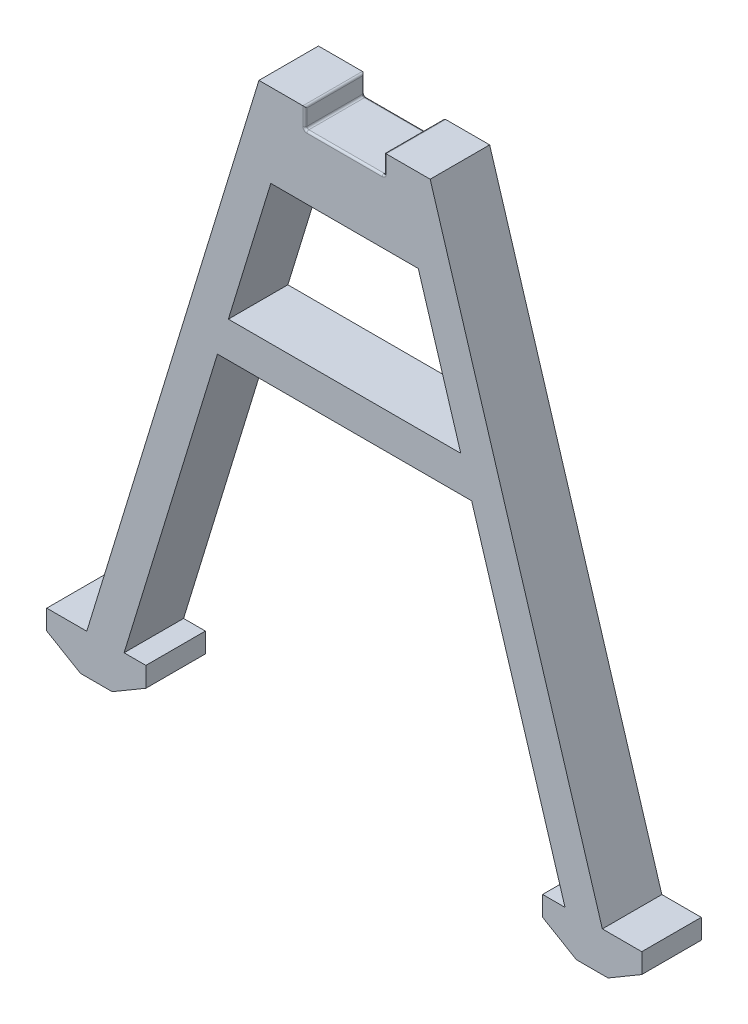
ISO-10303-21;
HEADER;
FILE_DESCRIPTION(('STEP AP214'),'2;1');
FILE_NAME('part.step','',(''),(''),'','','');
FILE_SCHEMA(('AUTOMOTIVE_DESIGN { 1 0 10303 214 1 1 1 1 }'));
ENDSEC;
DATA;
#1=APPLICATION_CONTEXT('core data for automotive mechanical design processes');
#2=APPLICATION_PROTOCOL_DEFINITION('international standard','automotive_design',2000,#1);
#3=PRODUCT_CONTEXT('',#1,'mechanical');
#4=PRODUCT('Part','Part','',(#3));
#5=PRODUCT_RELATED_PRODUCT_CATEGORY('part','',(#4));
#6=PRODUCT_DEFINITION_FORMATION('','',#4);
#7=PRODUCT_DEFINITION_CONTEXT('part definition',#1,'design');
#8=PRODUCT_DEFINITION('design','',#6,#7);
#9=PRODUCT_DEFINITION_SHAPE('','',#8);
#10=(LENGTH_UNIT() NAMED_UNIT(*) SI_UNIT(.MILLI.,.METRE.));
#11=(NAMED_UNIT(*) PLANE_ANGLE_UNIT() SI_UNIT($,.RADIAN.));
#12=(NAMED_UNIT(*) SI_UNIT($,.STERADIAN.) SOLID_ANGLE_UNIT());
#13=UNCERTAINTY_MEASURE_WITH_UNIT(LENGTH_MEASURE(1.E-05),#10,'distance_accuracy_value','');
#14=(GEOMETRIC_REPRESENTATION_CONTEXT(3) GLOBAL_UNCERTAINTY_ASSIGNED_CONTEXT((#13)) GLOBAL_UNIT_ASSIGNED_CONTEXT((#10,
#11,#12)) REPRESENTATION_CONTEXT('',''));
#15=CARTESIAN_POINT('',(0.,0.,0.));
#16=DIRECTION('',(0.,0.,1.));
#17=DIRECTION('',(1.,0.,0.));
#18=AXIS2_PLACEMENT_3D('',#15,#16,#17);
#19=CARTESIAN_POINT('',(0.,0.,7.5));
#20=DIRECTION('',(0.,0.,-1.));
#21=DIRECTION('',(-1.,0.,0.));
#22=AXIS2_PLACEMENT_3D('',#19,#20,#21);
#23=PLANE('',#22);
#24=DIRECTION('',(1.,0.,0.));
#25=VECTOR('',#24,1.);
#26=CARTESIAN_POINT('',(-29.2959355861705,101.,7.5));
#27=LINE('',#26,#25);
#28=CARTESIAN_POINT('',(-29.2959355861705,101.,7.5));
#29=VERTEX_POINT('',#28);
#30=CARTESIAN_POINT('',(29.2959355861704,101.,7.5));
#31=VERTEX_POINT('',#30);
#32=EDGE_CURVE('E329',#29,#31,#27,.T.);
#33=ORIENTED_EDGE('',*,*,#32,.F.);
#34=DIRECTION('',(-0.292371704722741,-0.956304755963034,0.));
#35=VECTOR('',#34,1.);
#36=CARTESIAN_POINT('',(-18.5953617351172,136.,7.5));
#37=LINE('',#36,#35);
#38=CARTESIAN_POINT('',(-18.5953617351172,136.,7.5));
#39=VERTEX_POINT('',#38);
#40=EDGE_CURVE('E327',#39,#29,#37,.T.);
#41=ORIENTED_EDGE('',*,*,#40,.F.);
#42=DIRECTION('',(-1.,0.,0.));
#43=VECTOR('',#42,1.);
#44=CARTESIAN_POINT('',(18.5953617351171,136.,7.5));
#45=LINE('',#44,#43);
#46=CARTESIAN_POINT('',(18.5953617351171,136.,7.5));
#47=VERTEX_POINT('',#46);
#48=EDGE_CURVE('E335',#47,#39,#45,.T.);
#49=ORIENTED_EDGE('',*,*,#48,.F.);
#50=DIRECTION('',(-0.292371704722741,0.956304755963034,0.));
#51=VECTOR('',#50,1.);
#52=CARTESIAN_POINT('',(29.2959355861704,101.,7.5));
#53=LINE('',#52,#51);
#54=EDGE_CURVE('E332',#31,#47,#53,.T.);
#55=ORIENTED_EDGE('',*,*,#54,.F.);
#56=EDGE_LOOP('',(#33,#41,#49,#55));
#57=FACE_BOUND('',#56,.T.);
#58=DIRECTION('',(0.,1.,0.));
#59=VECTOR('',#58,1.);
#60=CARTESIAN_POINT('',(-75.091397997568,0.,7.5));
#61=LINE('',#60,#59);
#62=CARTESIAN_POINT('',(-75.091397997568,10.,7.5));
#63=VERTEX_POINT('',#62);
#64=CARTESIAN_POINT('',(-75.091397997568,15.,7.5));
#65=VERTEX_POINT('',#64);
#66=EDGE_CURVE('E297',#63,#65,#61,.T.);
#67=ORIENTED_EDGE('',*,*,#66,.F.);
#68=DIRECTION('',(-0.86193421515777,0.507020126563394,0.));
#69=VECTOR('',#68,1.);
#70=CARTESIAN_POINT('',(-75.091397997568,10.,7.5));
#71=LINE('',#70,#69);
#72=CARTESIAN_POINT('',(-66.591397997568,5.,7.5));
#73=VERTEX_POINT('',#72);
#74=EDGE_CURVE('E276',#73,#63,#71,.T.);
#75=ORIENTED_EDGE('',*,*,#74,.F.);
#76=DIRECTION('',(-1.,0.,0.));
#77=VECTOR('',#76,1.);
#78=CARTESIAN_POINT('',(-75.091397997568,5.,7.5));
#79=LINE('',#78,#77);
#80=CARTESIAN_POINT('',(-58.591397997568,5.,7.5));
#81=VERTEX_POINT('',#80);
#82=EDGE_CURVE('E591',#81,#73,#79,.T.);
#83=ORIENTED_EDGE('',*,*,#82,.F.);
#84=DIRECTION('',(-0.86193421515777,-0.507020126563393,0.));
#85=VECTOR('',#84,1.);
#86=CARTESIAN_POINT('',(-58.591397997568,5.,7.5));
#87=LINE('',#86,#85);
#88=CARTESIAN_POINT('',(-50.091397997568,10.,7.5));
#89=VERTEX_POINT('',#88);
#90=EDGE_CURVE('E66',#89,#81,#87,.T.);
#91=ORIENTED_EDGE('',*,*,#90,.F.);
#92=DIRECTION('',(0.,1.,0.));
#93=VECTOR('',#92,1.);
#94=CARTESIAN_POINT('',(-50.091397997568,0.,7.5));
#95=LINE('',#94,#93);
#96=CARTESIAN_POINT('',(-50.091397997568,15.,7.5));
#97=VERTEX_POINT('',#96);
#98=EDGE_CURVE('E300',#89,#97,#95,.T.);
#99=ORIENTED_EDGE('',*,*,#98,.T.);
#100=DIRECTION('',(1.,0.,0.));
#101=VECTOR('',#100,1.);
#102=CARTESIAN_POINT('',(-75.091397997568,15.,7.5));
#103=LINE('',#102,#101);
#104=CARTESIAN_POINT('',(-55.5887741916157,15.,7.5));
#105=VERTEX_POINT('',#104);
#106=EDGE_CURVE('E510',#105,#97,#103,.T.);
#107=ORIENTED_EDGE('',*,*,#106,.F.);
#108=DIRECTION('',(-0.292371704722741,-0.956304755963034,0.));
#109=VECTOR('',#108,1.);
#110=CARTESIAN_POINT('',(-32.0475117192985,92.,7.5));
#111=LINE('',#110,#109);
#112=CARTESIAN_POINT('',(-32.0475117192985,92.,7.5));
#113=VERTEX_POINT('',#112);
#114=EDGE_CURVE('E306',#113,#105,#111,.T.);
#115=ORIENTED_EDGE('',*,*,#114,.F.);
#116=DIRECTION('',(-1.,0.,0.));
#117=VECTOR('',#116,1.);
#118=CARTESIAN_POINT('',(32.0475117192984,92.,7.5));
#119=LINE('',#118,#117);
#120=CARTESIAN_POINT('',(32.0475117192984,92.,7.5));
#121=VERTEX_POINT('',#120);
#122=EDGE_CURVE('E313',#121,#113,#119,.T.);
#123=ORIENTED_EDGE('',*,*,#122,.F.);
#124=DIRECTION('',(-0.292371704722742,0.956304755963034,0.));
#125=VECTOR('',#124,1.);
#126=CARTESIAN_POINT('',(55.5887741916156,15.,7.5));
#127=LINE('',#126,#125);
#128=CARTESIAN_POINT('',(55.5887741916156,15.,7.5));
#129=VERTEX_POINT('',#128);
#130=EDGE_CURVE('E309',#129,#121,#127,.T.);
#131=ORIENTED_EDGE('',*,*,#130,.F.);
#132=DIRECTION('',(1.,0.,0.));
#133=VECTOR('',#132,1.);
#134=CARTESIAN_POINT('',(49.9385869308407,15.,7.5));
#135=LINE('',#134,#133);
#136=CARTESIAN_POINT('',(49.9385869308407,15.,7.5));
#137=VERTEX_POINT('',#136);
#138=EDGE_CURVE('E550',#137,#129,#135,.T.);
#139=ORIENTED_EDGE('',*,*,#138,.F.);
#140=DIRECTION('',(0.,1.,0.));
#141=VECTOR('',#140,1.);
#142=CARTESIAN_POINT('',(49.9385869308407,0.,7.5));
#143=LINE('',#142,#141);
#144=CARTESIAN_POINT('',(49.9385869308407,10.,7.5));
#145=VERTEX_POINT('',#144);
#146=EDGE_CURVE('E553',#145,#137,#143,.T.);
#147=ORIENTED_EDGE('',*,*,#146,.F.);
#148=DIRECTION('',(-0.86193421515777,0.507020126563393,0.));
#149=VECTOR('',#148,1.);
#150=CARTESIAN_POINT('',(49.9385869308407,10.,7.5));
#151=LINE('',#150,#149);
#152=CARTESIAN_POINT('',(58.4385869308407,5.,7.5));
#153=VERTEX_POINT('',#152);
#154=EDGE_CURVE('E614',#153,#145,#151,.T.);
#155=ORIENTED_EDGE('',*,*,#154,.F.);
#156=DIRECTION('',(-1.,0.,0.));
#157=VECTOR('',#156,1.);
#158=CARTESIAN_POINT('',(49.9385869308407,5.,7.5));
#159=LINE('',#158,#157);
#160=CARTESIAN_POINT('',(66.4385869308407,5.,7.5));
#161=VERTEX_POINT('',#160);
#162=EDGE_CURVE('E280',#161,#153,#159,.T.);
#163=ORIENTED_EDGE('',*,*,#162,.F.);
#164=DIRECTION('',(-0.86193421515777,-0.507020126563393,0.));
#165=VECTOR('',#164,1.);
#166=CARTESIAN_POINT('',(74.9385869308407,10.,7.5));
#167=LINE('',#166,#165);
#168=CARTESIAN_POINT('',(74.9385869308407,10.,7.5));
#169=VERTEX_POINT('',#168);
#170=EDGE_CURVE('E606',#169,#161,#167,.T.);
#171=ORIENTED_EDGE('',*,*,#170,.F.);
#172=DIRECTION('',(0.,1.,0.));
#173=VECTOR('',#172,1.);
#174=CARTESIAN_POINT('',(74.9385869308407,0.,7.5));
#175=LINE('',#174,#173);
#176=CARTESIAN_POINT('',(74.9385869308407,15.,7.5));
#177=VERTEX_POINT('',#176);
#178=EDGE_CURVE('E531',#169,#177,#175,.T.);
#179=ORIENTED_EDGE('',*,*,#178,.T.);
#180=CARTESIAN_POINT('',(65.,15.,7.5));
#181=VERTEX_POINT('',#180);
#182=EDGE_CURVE('E556',#181,#177,#135,.T.);
#183=ORIENTED_EDGE('',*,*,#182,.F.);
#184=DIRECTION('',(-0.292371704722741,0.956304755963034,0.));
#185=VECTOR('',#184,1.);
#186=CARTESIAN_POINT('',(21.5862432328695,157.,7.5));
#187=LINE('',#186,#185);
#188=CARTESIAN_POINT('',(21.5862432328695,157.,7.5));
#189=VERTEX_POINT('',#188);
#190=EDGE_CURVE('E346',#181,#189,#187,.T.);
#191=ORIENTED_EDGE('',*,*,#190,.T.);
#192=DIRECTION('',(-1.,0.,0.));
#193=VECTOR('',#192,1.);
#194=CARTESIAN_POINT('',(-21.5862432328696,157.,7.5));
#195=LINE('',#194,#193);
#196=CARTESIAN_POINT('',(10.5,157.,7.5));
#197=VERTEX_POINT('',#196);
#198=EDGE_CURVE('E350',#189,#197,#195,.T.);
#199=ORIENTED_EDGE('',*,*,#198,.T.);
#200=DIRECTION('',(0.,1.,0.));
#201=VECTOR('',#200,1.);
#202=CARTESIAN_POINT('',(10.5,0.,7.5));
#203=LINE('',#202,#201);
#204=CARTESIAN_POINT('',(10.5,152.5,7.5));
#205=VERTEX_POINT('',#204);
#206=EDGE_CURVE('E423',#197,#205,#203,.F.);
#207=ORIENTED_EDGE('',*,*,#206,.T.);
#208=CARTESIAN_POINT('',(9.5,152.5,7.5));
#209=DIRECTION('',(0.,0.,-1.));
#210=DIRECTION('',(-1.,0.,0.));
#211=AXIS2_PLACEMENT_3D('',#208,#209,#210);
#212=CIRCLE('',#211,1.);
#213=CARTESIAN_POINT('',(9.5,151.5,7.5));
#214=VERTEX_POINT('',#213);
#215=EDGE_CURVE('E420',#214,#205,#212,.F.);
#216=ORIENTED_EDGE('',*,*,#215,.F.);
#217=DIRECTION('',(1.,0.,0.));
#218=VECTOR('',#217,1.);
#219=CARTESIAN_POINT('',(0.,151.5,7.5));
#220=LINE('',#219,#218);
#221=CARTESIAN_POINT('',(-9.5,151.5,7.5));
#222=VERTEX_POINT('',#221);
#223=EDGE_CURVE('E416',#214,#222,#220,.F.);
#224=ORIENTED_EDGE('',*,*,#223,.T.);
#225=CARTESIAN_POINT('',(-9.5,152.5,7.5));
#226=DIRECTION('',(0.,0.,-1.));
#227=DIRECTION('',(-1.,0.,0.));
#228=AXIS2_PLACEMENT_3D('',#225,#226,#227);
#229=CIRCLE('',#228,1.);
#230=CARTESIAN_POINT('',(-10.5,152.5,7.5));
#231=VERTEX_POINT('',#230);
#232=EDGE_CURVE('E413',#231,#222,#229,.F.);
#233=ORIENTED_EDGE('',*,*,#232,.F.);
#234=DIRECTION('',(0.,-1.,0.));
#235=VECTOR('',#234,1.);
#236=CARTESIAN_POINT('',(-10.5,0.,7.5));
#237=LINE('',#236,#235);
#238=CARTESIAN_POINT('',(-10.5,157.,7.5));
#239=VERTEX_POINT('',#238);
#240=EDGE_CURVE('E418',#231,#239,#237,.F.);
#241=ORIENTED_EDGE('',*,*,#240,.T.);
#242=CARTESIAN_POINT('',(-21.5862432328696,157.,7.5));
#243=VERTEX_POINT('',#242);
#244=EDGE_CURVE('E348',#239,#243,#195,.T.);
#245=ORIENTED_EDGE('',*,*,#244,.T.);
#246=DIRECTION('',(-0.292371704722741,-0.956304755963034,0.));
#247=VECTOR('',#246,1.);
#248=CARTESIAN_POINT('',(-65.,15.,7.5));
#249=LINE('',#248,#247);
#250=CARTESIAN_POINT('',(-65.,15.,7.5));
#251=VERTEX_POINT('',#250);
#252=EDGE_CURVE('E353',#243,#251,#249,.T.);
#253=ORIENTED_EDGE('',*,*,#252,.T.);
#254=EDGE_CURVE('E302',#65,#251,#103,.T.);
#255=ORIENTED_EDGE('',*,*,#254,.F.);
#256=EDGE_LOOP('',(#67,#75,#83,#91,#99,#107,#115,#123,#131,#139,#147,#155,#163,#171,#179,#183,
#191,#199,#207,#216,#224,#233,#241,#245,#253,#255));
#257=FACE_BOUND('',#256,.T.);
#258=ADVANCED_FACE('F41',(#57,#257),#23,.F.);
#259=CARTESIAN_POINT('',(0.,0.,-7.5));
#260=DIRECTION('',(0.,0.,-1.));
#261=DIRECTION('',(-1.,0.,0.));
#262=AXIS2_PLACEMENT_3D('',#259,#260,#261);
#263=PLANE('',#262);
#264=DIRECTION('',(-0.86193421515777,0.507020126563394,0.));
#265=VECTOR('',#264,1.);
#266=CARTESIAN_POINT('',(-75.091397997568,10.,-7.5));
#267=LINE('',#266,#265);
#268=CARTESIAN_POINT('',(-66.591397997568,5.,-7.5));
#269=VERTEX_POINT('',#268);
#270=CARTESIAN_POINT('',(-75.091397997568,10.,-7.5));
#271=VERTEX_POINT('',#270);
#272=EDGE_CURVE('E58',#269,#271,#267,.T.);
#273=ORIENTED_EDGE('',*,*,#272,.T.);
#274=DIRECTION('',(0.,1.,0.));
#275=VECTOR('',#274,1.);
#276=CARTESIAN_POINT('',(-75.091397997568,0.,-7.5));
#277=LINE('',#276,#275);
#278=CARTESIAN_POINT('',(-75.091397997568,15.,-7.5));
#279=VERTEX_POINT('',#278);
#280=EDGE_CURVE('E287',#271,#279,#277,.T.);
#281=ORIENTED_EDGE('',*,*,#280,.T.);
#282=DIRECTION('',(-1.,0.,0.));
#283=VECTOR('',#282,1.);
#284=CARTESIAN_POINT('',(-75.091397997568,15.,-7.5));
#285=LINE('',#284,#283);
#286=CARTESIAN_POINT('',(-65.,15.,-7.5));
#287=VERTEX_POINT('',#286);
#288=EDGE_CURVE('E513',#287,#279,#285,.T.);
#289=ORIENTED_EDGE('',*,*,#288,.F.);
#290=DIRECTION('',(-0.292371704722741,-0.956304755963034,0.));
#291=VECTOR('',#290,1.);
#292=CARTESIAN_POINT('',(-65.,15.,-7.5));
#293=LINE('',#292,#291);
#294=CARTESIAN_POINT('',(-21.5862432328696,157.,-7.5));
#295=VERTEX_POINT('',#294);
#296=EDGE_CURVE('E349',#295,#287,#293,.T.);
#297=ORIENTED_EDGE('',*,*,#296,.F.);
#298=DIRECTION('',(-1.,0.,0.));
#299=VECTOR('',#298,1.);
#300=CARTESIAN_POINT('',(-21.5862432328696,157.,-7.5));
#301=LINE('',#300,#299);
#302=CARTESIAN_POINT('',(-10.5,157.,-7.5));
#303=VERTEX_POINT('',#302);
#304=EDGE_CURVE('E358',#303,#295,#301,.T.);
#305=ORIENTED_EDGE('',*,*,#304,.F.);
#306=DIRECTION('',(0.,1.,0.));
#307=VECTOR('',#306,1.);
#308=CARTESIAN_POINT('',(-10.5,152.,-7.5));
#309=LINE('',#308,#307);
#310=CARTESIAN_POINT('',(-10.5,152.5,-7.5));
#311=VERTEX_POINT('',#310);
#312=EDGE_CURVE('E408',#303,#311,#309,.F.);
#313=ORIENTED_EDGE('',*,*,#312,.T.);
#314=CARTESIAN_POINT('',(-9.5,152.5,-7.5));
#315=DIRECTION('',(0.,0.,-1.));
#316=DIRECTION('',(-1.,0.,0.));
#317=AXIS2_PLACEMENT_3D('',#314,#315,#316);
#318=CIRCLE('',#317,1.);
#319=CARTESIAN_POINT('',(-9.5,151.5,-7.5));
#320=VERTEX_POINT('',#319);
#321=EDGE_CURVE('E405',#320,#311,#318,.T.);
#322=ORIENTED_EDGE('',*,*,#321,.F.);
#323=DIRECTION('',(-1.,0.,0.));
#324=VECTOR('',#323,1.);
#325=CARTESIAN_POINT('',(10.,151.5,-7.5));
#326=LINE('',#325,#324);
#327=CARTESIAN_POINT('',(9.5,151.5,-7.5));
#328=VERTEX_POINT('',#327);
#329=EDGE_CURVE('E403',#320,#328,#326,.F.);
#330=ORIENTED_EDGE('',*,*,#329,.T.);
#331=CARTESIAN_POINT('',(9.5,152.5,-7.5));
#332=DIRECTION('',(0.,0.,-1.));
#333=DIRECTION('',(-1.,0.,0.));
#334=AXIS2_PLACEMENT_3D('',#331,#332,#333);
#335=CIRCLE('',#334,1.);
#336=CARTESIAN_POINT('',(10.5,152.5,-7.5));
#337=VERTEX_POINT('',#336);
#338=EDGE_CURVE('E400',#337,#328,#335,.T.);
#339=ORIENTED_EDGE('',*,*,#338,.F.);
#340=DIRECTION('',(0.,-1.,0.));
#341=VECTOR('',#340,1.);
#342=CARTESIAN_POINT('',(10.5,157.,-7.5));
#343=LINE('',#342,#341);
#344=CARTESIAN_POINT('',(10.5,157.,-7.5));
#345=VERTEX_POINT('',#344);
#346=EDGE_CURVE('E410',#337,#345,#343,.F.);
#347=ORIENTED_EDGE('',*,*,#346,.T.);
#348=CARTESIAN_POINT('',(21.5862432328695,157.,-7.5));
#349=VERTEX_POINT('',#348);
#350=EDGE_CURVE('E359',#349,#345,#301,.T.);
#351=ORIENTED_EDGE('',*,*,#350,.F.);
#352=DIRECTION('',(-0.292371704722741,0.956304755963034,0.));
#353=VECTOR('',#352,1.);
#354=CARTESIAN_POINT('',(21.5862432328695,157.,-7.5));
#355=LINE('',#354,#353);
#356=CARTESIAN_POINT('',(65.,15.,-7.5));
#357=VERTEX_POINT('',#356);
#358=EDGE_CURVE('E319',#357,#349,#355,.T.);
#359=ORIENTED_EDGE('',*,*,#358,.F.);
#360=DIRECTION('',(-1.,0.,0.));
#361=VECTOR('',#360,1.);
#362=CARTESIAN_POINT('',(49.9385869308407,15.,-7.5));
#363=LINE('',#362,#361);
#364=CARTESIAN_POINT('',(74.9385869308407,15.,-7.5));
#365=VERTEX_POINT('',#364);
#366=EDGE_CURVE('E565',#365,#357,#363,.T.);
#367=ORIENTED_EDGE('',*,*,#366,.F.);
#368=DIRECTION('',(0.,1.,0.));
#369=VECTOR('',#368,1.);
#370=CARTESIAN_POINT('',(74.9385869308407,0.,-7.5));
#371=LINE('',#370,#369);
#372=CARTESIAN_POINT('',(74.9385869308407,10.,-7.5));
#373=VERTEX_POINT('',#372);
#374=EDGE_CURVE('E555',#373,#365,#371,.T.);
#375=ORIENTED_EDGE('',*,*,#374,.F.);
#376=DIRECTION('',(-0.86193421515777,-0.507020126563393,0.));
#377=VECTOR('',#376,1.);
#378=CARTESIAN_POINT('',(74.9385869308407,10.,-7.5));
#379=LINE('',#378,#377);
#380=CARTESIAN_POINT('',(66.4385869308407,5.,-7.5));
#381=VERTEX_POINT('',#380);
#382=EDGE_CURVE('E603',#373,#381,#379,.T.);
#383=ORIENTED_EDGE('',*,*,#382,.T.);
#384=DIRECTION('',(1.,0.,0.));
#385=VECTOR('',#384,1.);
#386=CARTESIAN_POINT('',(49.9385869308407,5.,-7.5));
#387=LINE('',#386,#385);
#388=CARTESIAN_POINT('',(58.4385869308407,5.,-7.5));
#389=VERTEX_POINT('',#388);
#390=EDGE_CURVE('E594',#389,#381,#387,.T.);
#391=ORIENTED_EDGE('',*,*,#390,.F.);
#392=DIRECTION('',(-0.86193421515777,0.507020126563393,0.));
#393=VECTOR('',#392,1.);
#394=CARTESIAN_POINT('',(49.9385869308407,10.,-7.5));
#395=LINE('',#394,#393);
#396=CARTESIAN_POINT('',(49.9385869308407,10.,-7.5));
#397=VERTEX_POINT('',#396);
#398=EDGE_CURVE('E620',#389,#397,#395,.T.);
#399=ORIENTED_EDGE('',*,*,#398,.T.);
#400=DIRECTION('',(0.,1.,0.));
#401=VECTOR('',#400,1.);
#402=CARTESIAN_POINT('',(49.9385869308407,0.,-7.5));
#403=LINE('',#402,#401);
#404=CARTESIAN_POINT('',(49.9385869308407,15.,-7.5));
#405=VERTEX_POINT('',#404);
#406=EDGE_CURVE('E573',#397,#405,#403,.T.);
#407=ORIENTED_EDGE('',*,*,#406,.T.);
#408=CARTESIAN_POINT('',(55.5887741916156,15.,-7.5));
#409=VERTEX_POINT('',#408);
#410=EDGE_CURVE('E562',#409,#405,#363,.T.);
#411=ORIENTED_EDGE('',*,*,#410,.F.);
#412=DIRECTION('',(0.292371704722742,-0.956304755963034,0.));
#413=VECTOR('',#412,1.);
#414=CARTESIAN_POINT('',(55.030925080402,16.8246422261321,-7.5));
#415=LINE('',#414,#413);
#416=CARTESIAN_POINT('',(32.0475117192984,92.,-7.5));
#417=VERTEX_POINT('',#416);
#418=EDGE_CURVE('E384',#417,#409,#415,.T.);
#419=ORIENTED_EDGE('',*,*,#418,.F.);
#420=DIRECTION('',(1.,0.,0.));
#421=VECTOR('',#420,1.);
#422=CARTESIAN_POINT('',(0.,92.,-7.5));
#423=LINE('',#422,#421);
#424=CARTESIAN_POINT('',(-32.0475117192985,92.,-7.5));
#425=VERTEX_POINT('',#424);
#426=EDGE_CURVE('E387',#425,#417,#423,.T.);
#427=ORIENTED_EDGE('',*,*,#426,.F.);
#428=DIRECTION('',(0.292371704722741,0.956304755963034,0.));
#429=VECTOR('',#428,1.);
#430=CARTESIAN_POINT('',(-55.0309250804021,16.8246422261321,-7.5));
#431=LINE('',#430,#429);
#432=CARTESIAN_POINT('',(-55.5887741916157,15.,-7.5));
#433=VERTEX_POINT('',#432);
#434=EDGE_CURVE('E389',#433,#425,#431,.T.);
#435=ORIENTED_EDGE('',*,*,#434,.F.);
#436=CARTESIAN_POINT('',(-50.091397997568,15.,-7.5));
#437=VERTEX_POINT('',#436);
#438=EDGE_CURVE('E514',#437,#433,#285,.T.);
#439=ORIENTED_EDGE('',*,*,#438,.F.);
#440=DIRECTION('',(0.,1.,0.));
#441=VECTOR('',#440,1.);
#442=CARTESIAN_POINT('',(-50.091397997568,0.,-7.5));
#443=LINE('',#442,#441);
#444=CARTESIAN_POINT('',(-50.091397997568,10.,-7.5));
#445=VERTEX_POINT('',#444);
#446=EDGE_CURVE('E298',#445,#437,#443,.T.);
#447=ORIENTED_EDGE('',*,*,#446,.F.);
#448=DIRECTION('',(-0.86193421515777,-0.507020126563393,0.));
#449=VECTOR('',#448,1.);
#450=CARTESIAN_POINT('',(-58.591397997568,5.,-7.5));
#451=LINE('',#450,#449);
#452=CARTESIAN_POINT('',(-58.591397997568,5.,-7.5));
#453=VERTEX_POINT('',#452);
#454=EDGE_CURVE('E612',#445,#453,#451,.T.);
#455=ORIENTED_EDGE('',*,*,#454,.T.);
#456=DIRECTION('',(1.,0.,0.));
#457=VECTOR('',#456,1.);
#458=CARTESIAN_POINT('',(-75.091397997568,5.,-7.5));
#459=LINE('',#458,#457);
#460=EDGE_CURVE('E291',#269,#453,#459,.T.);
#461=ORIENTED_EDGE('',*,*,#460,.F.);
#462=EDGE_LOOP('',(#273,#281,#289,#297,#305,#313,#322,#330,#339,#347,#351,#359,#367,#375,#383,
#391,#399,#407,#411,#419,#427,#435,#439,#447,#455,#461));
#463=FACE_BOUND('',#462,.T.);
#464=DIRECTION('',(0.292371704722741,0.956304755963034,0.));
#465=VECTOR('',#464,1.);
#466=CARTESIAN_POINT('',(-55.0309250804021,16.8246422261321,-7.5));
#467=LINE('',#466,#465);
#468=CARTESIAN_POINT('',(-29.2959355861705,101.,-7.5));
#469=VERTEX_POINT('',#468);
#470=CARTESIAN_POINT('',(-18.5953617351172,136.,-7.5));
#471=VERTEX_POINT('',#470);
#472=EDGE_CURVE('E382',#469,#471,#467,.T.);
#473=ORIENTED_EDGE('',*,*,#472,.F.);
#474=DIRECTION('',(-1.,0.,0.));
#475=VECTOR('',#474,1.);
#476=CARTESIAN_POINT('',(0.,101.,-7.5));
#477=LINE('',#476,#475);
#478=CARTESIAN_POINT('',(29.2959355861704,101.,-7.5));
#479=VERTEX_POINT('',#478);
#480=EDGE_CURVE('E375',#479,#469,#477,.T.);
#481=ORIENTED_EDGE('',*,*,#480,.F.);
#482=DIRECTION('',(0.292371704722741,-0.956304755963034,0.));
#483=VECTOR('',#482,1.);
#484=CARTESIAN_POINT('',(55.030925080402,16.8246422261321,-7.5));
#485=LINE('',#484,#483);
#486=CARTESIAN_POINT('',(18.5953617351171,136.,-7.5));
#487=VERTEX_POINT('',#486);
#488=EDGE_CURVE('E377',#487,#479,#485,.T.);
#489=ORIENTED_EDGE('',*,*,#488,.F.);
#490=DIRECTION('',(1.,0.,0.));
#491=VECTOR('',#490,1.);
#492=CARTESIAN_POINT('',(0.,136.,-7.5));
#493=LINE('',#492,#491);
#494=EDGE_CURVE('E380',#471,#487,#493,.T.);
#495=ORIENTED_EDGE('',*,*,#494,.F.);
#496=EDGE_LOOP('',(#473,#481,#489,#495));
#497=FACE_BOUND('',#496,.T.);
#498=ADVANCED_FACE('F285',(#463,#497),#263,.T.);
#499=CARTESIAN_POINT('',(49.9385869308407,0.,-7.5));
#500=DIRECTION('',(-1.,0.,0.));
#501=DIRECTION('',(0.,0.,1.));
#502=AXIS2_PLACEMENT_3D('',#499,#500,#501);
#503=PLANE('',#502);
#504=DIRECTION('',(0.,0.,1.));
#505=VECTOR('',#504,1.);
#506=CARTESIAN_POINT('',(49.9385869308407,10.,-7.5));
#507=LINE('',#506,#505);
#508=EDGE_CURVE('E619',#397,#145,#507,.T.);
#509=ORIENTED_EDGE('',*,*,#508,.T.);
#510=ORIENTED_EDGE('',*,*,#146,.T.);
#511=DIRECTION('',(0.,0.,1.));
#512=VECTOR('',#511,1.);
#513=CARTESIAN_POINT('',(49.9385869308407,15.,-7.5));
#514=LINE('',#513,#512);
#515=EDGE_CURVE('E560',#405,#137,#514,.T.);
#516=ORIENTED_EDGE('',*,*,#515,.F.);
#517=ORIENTED_EDGE('',*,*,#406,.F.);
#518=EDGE_LOOP('',(#509,#510,#516,#517));
#519=FACE_BOUND('',#518,.T.);
#520=ADVANCED_FACE('F648',(#519),#503,.T.);
#521=CARTESIAN_POINT('',(74.9385869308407,0.,-7.5));
#522=DIRECTION('',(1.,0.,0.));
#523=DIRECTION('',(0.,0.,-1.));
#524=AXIS2_PLACEMENT_3D('',#521,#522,#523);
#525=PLANE('',#524);
#526=DIRECTION('',(0.,0.,1.));
#527=VECTOR('',#526,1.);
#528=CARTESIAN_POINT('',(74.9385869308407,10.,-7.5));
#529=LINE('',#528,#527);
#530=EDGE_CURVE('E584',#373,#169,#529,.T.);
#531=ORIENTED_EDGE('',*,*,#530,.F.);
#532=ORIENTED_EDGE('',*,*,#374,.T.);
#533=DIRECTION('',(0.,0.,-1.));
#534=VECTOR('',#533,1.);
#535=CARTESIAN_POINT('',(74.9385869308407,15.,-7.5));
#536=LINE('',#535,#534);
#537=EDGE_CURVE('E583',#177,#365,#536,.T.);
#538=ORIENTED_EDGE('',*,*,#537,.F.);
#539=ORIENTED_EDGE('',*,*,#178,.F.);
#540=EDGE_LOOP('',(#531,#532,#538,#539));
#541=FACE_BOUND('',#540,.T.);
#542=ADVANCED_FACE('F580',(#541),#525,.T.);
#543=CARTESIAN_POINT('',(-50.091397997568,0.,-7.5));
#544=DIRECTION('',(1.,0.,0.));
#545=DIRECTION('',(0.,0.,-1.));
#546=AXIS2_PLACEMENT_3D('',#543,#544,#545);
#547=PLANE('',#546);
#548=DIRECTION('',(0.,0.,1.));
#549=VECTOR('',#548,1.);
#550=CARTESIAN_POINT('',(-50.091397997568,10.,-7.5));
#551=LINE('',#550,#549);
#552=EDGE_CURVE('E609',#445,#89,#551,.T.);
#553=ORIENTED_EDGE('',*,*,#552,.F.);
#554=ORIENTED_EDGE('',*,*,#446,.T.);
#555=DIRECTION('',(0.,0.,-1.));
#556=VECTOR('',#555,1.);
#557=CARTESIAN_POINT('',(-50.091397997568,15.,-7.5));
#558=LINE('',#557,#556);
#559=EDGE_CURVE('E526',#97,#437,#558,.T.);
#560=ORIENTED_EDGE('',*,*,#559,.F.);
#561=ORIENTED_EDGE('',*,*,#98,.F.);
#562=EDGE_LOOP('',(#553,#554,#560,#561));
#563=FACE_BOUND('',#562,.T.);
#564=ADVANCED_FACE('F527',(#563),#547,.T.);
#565=CARTESIAN_POINT('',(-75.091397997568,0.,-7.5));
#566=DIRECTION('',(-1.,0.,0.));
#567=DIRECTION('',(0.,0.,1.));
#568=AXIS2_PLACEMENT_3D('',#565,#566,#567);
#569=PLANE('',#568);
#570=DIRECTION('',(0.,0.,1.));
#571=VECTOR('',#570,1.);
#572=CARTESIAN_POINT('',(-75.091397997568,10.,-7.5));
#573=LINE('',#572,#571);
#574=EDGE_CURVE('E273',#271,#63,#573,.T.);
#575=ORIENTED_EDGE('',*,*,#574,.T.);
#576=ORIENTED_EDGE('',*,*,#66,.T.);
#577=DIRECTION('',(0.,0.,1.));
#578=VECTOR('',#577,1.);
#579=CARTESIAN_POINT('',(-75.091397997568,15.,-7.5));
#580=LINE('',#579,#578);
#581=EDGE_CURVE('E295',#279,#65,#580,.T.);
#582=ORIENTED_EDGE('',*,*,#581,.F.);
#583=ORIENTED_EDGE('',*,*,#280,.F.);
#584=EDGE_LOOP('',(#575,#576,#582,#583));
#585=FACE_BOUND('',#584,.T.);
#586=ADVANCED_FACE('F293',(#585),#569,.T.);
#587=CARTESIAN_POINT('',(0.,15.,0.));
#588=DIRECTION('',(0.,1.,0.));
#589=DIRECTION('',(0.,0.,1.));
#590=AXIS2_PLACEMENT_3D('',#587,#588,#589);
#591=PLANE('',#590);
#592=DIRECTION('',(0.,0.,-1.));
#593=VECTOR('',#592,1.);
#594=CARTESIAN_POINT('',(65.,15.,7.5));
#595=LINE('',#594,#593);
#596=EDGE_CURVE('E372',#181,#357,#595,.T.);
#597=ORIENTED_EDGE('',*,*,#596,.F.);
#598=ORIENTED_EDGE('',*,*,#182,.T.);
#599=ORIENTED_EDGE('',*,*,#537,.T.);
#600=ORIENTED_EDGE('',*,*,#366,.T.);
#601=EDGE_LOOP('',(#597,#598,#599,#600));
#602=FACE_BOUND('',#601,.T.);
#603=ADVANCED_FACE('F590',(#602),#591,.T.);
#604=ORIENTED_EDGE('',*,*,#515,.T.);
#605=ORIENTED_EDGE('',*,*,#138,.T.);
#606=DIRECTION('',(0.,0.,1.));
#607=VECTOR('',#606,1.);
#608=CARTESIAN_POINT('',(55.5887741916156,15.,-22.5));
#609=LINE('',#608,#607);
#610=EDGE_CURVE('E322',#409,#129,#609,.T.);
#611=ORIENTED_EDGE('',*,*,#610,.F.);
#612=ORIENTED_EDGE('',*,*,#410,.T.);
#613=EDGE_LOOP('',(#604,#605,#611,#612));
#614=FACE_BOUND('',#613,.T.);
#615=ADVANCED_FACE('F561',(#614),#591,.T.);
#616=DIRECTION('',(0.,0.,1.));
#617=VECTOR('',#616,1.);
#618=CARTESIAN_POINT('',(-55.5887741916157,15.,-22.5));
#619=LINE('',#618,#617);
#620=EDGE_CURVE('E316',#433,#105,#619,.T.);
#621=ORIENTED_EDGE('',*,*,#620,.T.);
#622=ORIENTED_EDGE('',*,*,#106,.T.);
#623=ORIENTED_EDGE('',*,*,#559,.T.);
#624=ORIENTED_EDGE('',*,*,#438,.T.);
#625=EDGE_LOOP('',(#621,#622,#623,#624));
#626=FACE_BOUND('',#625,.T.);
#627=ADVANCED_FACE('F532',(#626),#591,.T.);
#628=ORIENTED_EDGE('',*,*,#581,.T.);
#629=ORIENTED_EDGE('',*,*,#254,.T.);
#630=DIRECTION('',(0.,0.,-1.));
#631=VECTOR('',#630,1.);
#632=CARTESIAN_POINT('',(-65.,15.,7.5));
#633=LINE('',#632,#631);
#634=EDGE_CURVE('E356',#251,#287,#633,.T.);
#635=ORIENTED_EDGE('',*,*,#634,.T.);
#636=ORIENTED_EDGE('',*,*,#288,.T.);
#637=EDGE_LOOP('',(#628,#629,#635,#636));
#638=FACE_BOUND('',#637,.T.);
#639=ADVANCED_FACE('F512',(#638),#591,.T.);
#640=CARTESIAN_POINT('',(-21.5862432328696,157.,7.5));
#641=DIRECTION('',(0.,-1.,0.));
#642=DIRECTION('',(1.,0.,0.));
#643=AXIS2_PLACEMENT_3D('',#640,#641,#642);
#644=PLANE('',#643);
#645=ORIENTED_EDGE('',*,*,#350,.T.);
#646=DIRECTION('',(0.,0.,1.));
#647=VECTOR('',#646,1.);
#648=CARTESIAN_POINT('',(10.5,157.,7.5));
#649=LINE('',#648,#647);
#650=EDGE_CURVE('E436',#345,#197,#649,.T.);
#651=ORIENTED_EDGE('',*,*,#650,.T.);
#652=ORIENTED_EDGE('',*,*,#198,.F.);
#653=DIRECTION('',(0.,0.,-1.));
#654=VECTOR('',#653,1.);
#655=CARTESIAN_POINT('',(21.5862432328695,157.,7.5));
#656=LINE('',#655,#654);
#657=EDGE_CURVE('E369',#189,#349,#656,.T.);
#658=ORIENTED_EDGE('',*,*,#657,.T.);
#659=EDGE_LOOP('',(#645,#651,#652,#658));
#660=FACE_BOUND('',#659,.T.);
#661=ADVANCED_FACE('F660',(#660),#644,.F.);
#662=CARTESIAN_POINT('',(21.5862432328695,157.,7.5));
#663=DIRECTION('',(-0.956304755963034,-0.292371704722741,0.));
#664=DIRECTION('',(0.292371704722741,-0.956304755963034,0.));
#665=AXIS2_PLACEMENT_3D('',#662,#663,#664);
#666=PLANE('',#665);
#667=ORIENTED_EDGE('',*,*,#358,.T.);
#668=ORIENTED_EDGE('',*,*,#657,.F.);
#669=ORIENTED_EDGE('',*,*,#190,.F.);
#670=ORIENTED_EDGE('',*,*,#596,.T.);
#671=EDGE_LOOP('',(#667,#668,#669,#670));
#672=FACE_BOUND('',#671,.T.);
#673=ADVANCED_FACE('F659',(#672),#666,.F.);
#674=ORIENTED_EDGE('',*,*,#244,.F.);
#675=DIRECTION('',(0.,0.,-1.));
#676=VECTOR('',#675,1.);
#677=CARTESIAN_POINT('',(-10.5,157.,7.5));
#678=LINE('',#677,#676);
#679=EDGE_CURVE('E434',#239,#303,#678,.T.);
#680=ORIENTED_EDGE('',*,*,#679,.T.);
#681=ORIENTED_EDGE('',*,*,#304,.T.);
#682=DIRECTION('',(0.,0.,-1.));
#683=VECTOR('',#682,1.);
#684=CARTESIAN_POINT('',(-21.5862432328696,157.,7.5));
#685=LINE('',#684,#683);
#686=EDGE_CURVE('E366',#243,#295,#685,.T.);
#687=ORIENTED_EDGE('',*,*,#686,.F.);
#688=EDGE_LOOP('',(#674,#680,#681,#687));
#689=FACE_BOUND('',#688,.T.);
#690=ADVANCED_FACE('F501',(#689),#644,.F.);
#691=CARTESIAN_POINT('',(-65.,15.,7.5));
#692=DIRECTION('',(0.956304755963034,-0.29237170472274,0.));
#693=DIRECTION('',(0.292371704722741,0.956304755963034,0.));
#694=AXIS2_PLACEMENT_3D('',#691,#692,#693);
#695=PLANE('',#694);
#696=ORIENTED_EDGE('',*,*,#296,.T.);
#697=ORIENTED_EDGE('',*,*,#634,.F.);
#698=ORIENTED_EDGE('',*,*,#252,.F.);
#699=ORIENTED_EDGE('',*,*,#686,.T.);
#700=EDGE_LOOP('',(#696,#697,#698,#699));
#701=FACE_BOUND('',#700,.T.);
#702=ADVANCED_FACE('F507',(#701),#695,.F.);
#703=CARTESIAN_POINT('',(10.,162.,-22.5));
#704=DIRECTION('',(1.,0.,0.));
#705=DIRECTION('',(0.,0.,-1.));
#706=AXIS2_PLACEMENT_3D('',#703,#704,#705);
#707=PLANE('',#706);
#708=DIRECTION('',(0.,1.,0.));
#709=VECTOR('',#708,1.);
#710=CARTESIAN_POINT('',(10.,162.,7.));
#711=LINE('',#710,#709);
#712=CARTESIAN_POINT('',(10.,152.5,7.));
#713=VERTEX_POINT('',#712);
#714=CARTESIAN_POINT('',(10.,156.5,7.));
#715=VERTEX_POINT('',#714);
#716=EDGE_CURVE('E393',#713,#715,#711,.T.);
#717=ORIENTED_EDGE('',*,*,#716,.T.);
#718=DIRECTION('',(0.,0.,1.));
#719=VECTOR('',#718,1.);
#720=CARTESIAN_POINT('',(10.,156.5,-22.5));
#721=LINE('',#720,#719);
#722=CARTESIAN_POINT('',(10.,156.5,-7.));
#723=VERTEX_POINT('',#722);
#724=EDGE_CURVE('E398',#715,#723,#721,.F.);
#725=ORIENTED_EDGE('',*,*,#724,.T.);
#726=DIRECTION('',(0.,-1.,0.));
#727=VECTOR('',#726,1.);
#728=CARTESIAN_POINT('',(10.,152.,-7.));
#729=LINE('',#728,#727);
#730=CARTESIAN_POINT('',(10.,152.5,-7.));
#731=VERTEX_POINT('',#730);
#732=EDGE_CURVE('E395',#723,#731,#729,.T.);
#733=ORIENTED_EDGE('',*,*,#732,.T.);
#734=DIRECTION('',(0.,0.,1.));
#735=VECTOR('',#734,1.);
#736=CARTESIAN_POINT('',(10.,152.5,7.5));
#737=LINE('',#736,#735);
#738=EDGE_CURVE('E391',#731,#713,#737,.T.);
#739=ORIENTED_EDGE('',*,*,#738,.T.);
#740=EDGE_LOOP('',(#717,#725,#733,#739));
#741=FACE_BOUND('',#740,.T.);
#742=ADVANCED_FACE('F652',(#741),#707,.F.);
#743=CARTESIAN_POINT('',(-10.,162.,-22.5));
#744=DIRECTION('',(-1.,0.,0.));
#745=DIRECTION('',(0.,0.,1.));
#746=AXIS2_PLACEMENT_3D('',#743,#744,#745);
#747=PLANE('',#746);
#748=DIRECTION('',(0.,1.,0.));
#749=VECTOR('',#748,1.);
#750=CARTESIAN_POINT('',(-10.,157.,-7.));
#751=LINE('',#750,#749);
#752=CARTESIAN_POINT('',(-10.,152.5,-7.));
#753=VERTEX_POINT('',#752);
#754=CARTESIAN_POINT('',(-10.,156.5,-7.));
#755=VERTEX_POINT('',#754);
#756=EDGE_CURVE('E429',#753,#755,#751,.T.);
#757=ORIENTED_EDGE('',*,*,#756,.T.);
#758=DIRECTION('',(0.,0.,-1.));
#759=VECTOR('',#758,1.);
#760=CARTESIAN_POINT('',(-10.,156.5,-22.5));
#761=LINE('',#760,#759);
#762=CARTESIAN_POINT('',(-10.,156.5,7.));
#763=VERTEX_POINT('',#762);
#764=EDGE_CURVE('E432',#755,#763,#761,.F.);
#765=ORIENTED_EDGE('',*,*,#764,.T.);
#766=DIRECTION('',(0.,-1.,0.));
#767=VECTOR('',#766,1.);
#768=CARTESIAN_POINT('',(-10.,162.,7.));
#769=LINE('',#768,#767);
#770=CARTESIAN_POINT('',(-10.,152.5,7.));
#771=VERTEX_POINT('',#770);
#772=EDGE_CURVE('E427',#763,#771,#769,.T.);
#773=ORIENTED_EDGE('',*,*,#772,.T.);
#774=DIRECTION('',(0.,0.,1.));
#775=VECTOR('',#774,1.);
#776=CARTESIAN_POINT('',(-10.,152.5,-7.5));
#777=LINE('',#776,#775);
#778=EDGE_CURVE('E425',#771,#753,#777,.F.);
#779=ORIENTED_EDGE('',*,*,#778,.T.);
#780=EDGE_LOOP('',(#757,#765,#773,#779));
#781=FACE_BOUND('',#780,.T.);
#782=ADVANCED_FACE('F746',(#781),#747,.F.);
#783=CARTESIAN_POINT('',(-10.,152.,-22.5));
#784=DIRECTION('',(0.,-1.,0.));
#785=DIRECTION('',(0.,0.,-1.));
#786=AXIS2_PLACEMENT_3D('',#783,#784,#785);
#787=PLANE('',#786);
#788=DIRECTION('',(0.,0.,1.));
#789=VECTOR('',#788,1.);
#790=CARTESIAN_POINT('',(-9.5,152.,7.5));
#791=LINE('',#790,#789);
#792=CARTESIAN_POINT('',(-9.5,152.,-7.));
#793=VERTEX_POINT('',#792);
#794=CARTESIAN_POINT('',(-9.5,152.,7.));
#795=VERTEX_POINT('',#794);
#796=EDGE_CURVE('E440',#793,#795,#791,.T.);
#797=ORIENTED_EDGE('',*,*,#796,.T.);
#798=DIRECTION('',(1.,0.,0.));
#799=VECTOR('',#798,1.);
#800=CARTESIAN_POINT('',(-10.,152.,7.));
#801=LINE('',#800,#799);
#802=CARTESIAN_POINT('',(9.5,152.,7.));
#803=VERTEX_POINT('',#802);
#804=EDGE_CURVE('E12',#795,#803,#801,.T.);
#805=ORIENTED_EDGE('',*,*,#804,.T.);
#806=DIRECTION('',(0.,0.,1.));
#807=VECTOR('',#806,1.);
#808=CARTESIAN_POINT('',(9.5,152.,-7.5));
#809=LINE('',#808,#807);
#810=CARTESIAN_POINT('',(9.5,152.,-7.));
#811=VERTEX_POINT('',#810);
#812=EDGE_CURVE('E50',#803,#811,#809,.F.);
#813=ORIENTED_EDGE('',*,*,#812,.T.);
#814=DIRECTION('',(-1.,0.,0.));
#815=VECTOR('',#814,1.);
#816=CARTESIAN_POINT('',(-10.,152.,-7.));
#817=LINE('',#816,#815);
#818=EDGE_CURVE('E438',#811,#793,#817,.T.);
#819=ORIENTED_EDGE('',*,*,#818,.T.);
#820=EDGE_LOOP('',(#797,#805,#813,#819));
#821=FACE_BOUND('',#820,.T.);
#822=ADVANCED_FACE('F743',(#821),#787,.F.);
#823=CARTESIAN_POINT('',(-18.5953617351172,136.,-22.5));
#824=DIRECTION('',(-0.956304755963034,0.292371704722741,0.));
#825=DIRECTION('',(-0.292371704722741,-0.956304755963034,0.));
#826=AXIS2_PLACEMENT_3D('',#823,#824,#825);
#827=PLANE('',#826);
#828=ORIENTED_EDGE('',*,*,#472,.T.);
#829=DIRECTION('',(0.,0.,1.));
#830=VECTOR('',#829,1.);
#831=CARTESIAN_POINT('',(-18.5953617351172,136.,-22.5));
#832=LINE('',#831,#830);
#833=EDGE_CURVE('E310',#471,#39,#832,.T.);
#834=ORIENTED_EDGE('',*,*,#833,.T.);
#835=ORIENTED_EDGE('',*,*,#40,.T.);
#836=DIRECTION('',(0.,0.,1.));
#837=VECTOR('',#836,1.);
#838=CARTESIAN_POINT('',(-29.2959355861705,101.,-22.5));
#839=LINE('',#838,#837);
#840=EDGE_CURVE('E338',#469,#29,#839,.T.);
#841=ORIENTED_EDGE('',*,*,#840,.F.);
#842=EDGE_LOOP('',(#828,#834,#835,#841));
#843=FACE_BOUND('',#842,.T.);
#844=ADVANCED_FACE('F733',(#843),#827,.F.);
#845=CARTESIAN_POINT('',(18.5953617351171,136.,-22.5));
#846=DIRECTION('',(0.,1.,0.));
#847=DIRECTION('',(0.,0.,1.));
#848=AXIS2_PLACEMENT_3D('',#845,#846,#847);
#849=PLANE('',#848);
#850=ORIENTED_EDGE('',*,*,#494,.T.);
#851=DIRECTION('',(0.,0.,1.));
#852=VECTOR('',#851,1.);
#853=CARTESIAN_POINT('',(18.5953617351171,136.,-22.5));
#854=LINE('',#853,#852);
#855=EDGE_CURVE('E340',#487,#47,#854,.T.);
#856=ORIENTED_EDGE('',*,*,#855,.T.);
#857=ORIENTED_EDGE('',*,*,#48,.T.);
#858=ORIENTED_EDGE('',*,*,#833,.F.);
#859=EDGE_LOOP('',(#850,#856,#857,#858));
#860=FACE_BOUND('',#859,.T.);
#861=ADVANCED_FACE('F729',(#860),#849,.F.);
#862=CARTESIAN_POINT('',(29.2959355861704,101.,-22.5));
#863=DIRECTION('',(0.956304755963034,0.292371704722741,0.));
#864=DIRECTION('',(-0.292371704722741,0.956304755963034,0.));
#865=AXIS2_PLACEMENT_3D('',#862,#863,#864);
#866=PLANE('',#865);
#867=ORIENTED_EDGE('',*,*,#488,.T.);
#868=DIRECTION('',(0.,0.,1.));
#869=VECTOR('',#868,1.);
#870=CARTESIAN_POINT('',(29.2959355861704,101.,-22.5));
#871=LINE('',#870,#869);
#872=EDGE_CURVE('E342',#479,#31,#871,.T.);
#873=ORIENTED_EDGE('',*,*,#872,.T.);
#874=ORIENTED_EDGE('',*,*,#54,.T.);
#875=ORIENTED_EDGE('',*,*,#855,.F.);
#876=EDGE_LOOP('',(#867,#873,#874,#875));
#877=FACE_BOUND('',#876,.T.);
#878=ADVANCED_FACE('F732',(#877),#866,.F.);
#879=CARTESIAN_POINT('',(-29.2959355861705,101.,-22.5));
#880=DIRECTION('',(0.,-1.,0.));
#881=DIRECTION('',(0.,0.,-1.));
#882=AXIS2_PLACEMENT_3D('',#879,#880,#881);
#883=PLANE('',#882);
#884=ORIENTED_EDGE('',*,*,#480,.T.);
#885=ORIENTED_EDGE('',*,*,#840,.T.);
#886=ORIENTED_EDGE('',*,*,#32,.T.);
#887=ORIENTED_EDGE('',*,*,#872,.F.);
#888=EDGE_LOOP('',(#884,#885,#886,#887));
#889=FACE_BOUND('',#888,.T.);
#890=ADVANCED_FACE('F728',(#889),#883,.F.);
#891=CARTESIAN_POINT('',(-32.0475117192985,92.,-22.5));
#892=DIRECTION('',(-0.956304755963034,0.292371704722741,0.));
#893=DIRECTION('',(-0.292371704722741,-0.956304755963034,0.));
#894=AXIS2_PLACEMENT_3D('',#891,#892,#893);
#895=PLANE('',#894);
#896=ORIENTED_EDGE('',*,*,#434,.T.);
#897=DIRECTION('',(0.,0.,1.));
#898=VECTOR('',#897,1.);
#899=CARTESIAN_POINT('',(-32.0475117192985,92.,-22.5));
#900=LINE('',#899,#898);
#901=EDGE_CURVE('E317',#425,#113,#900,.T.);
#902=ORIENTED_EDGE('',*,*,#901,.T.);
#903=ORIENTED_EDGE('',*,*,#114,.T.);
#904=ORIENTED_EDGE('',*,*,#620,.F.);
#905=EDGE_LOOP('',(#896,#902,#903,#904));
#906=FACE_BOUND('',#905,.T.);
#907=ADVANCED_FACE('F536',(#906),#895,.F.);
#908=CARTESIAN_POINT('',(32.0475117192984,92.,-22.5));
#909=DIRECTION('',(0.,1.,0.));
#910=DIRECTION('',(-1.,0.,0.));
#911=AXIS2_PLACEMENT_3D('',#908,#909,#910);
#912=PLANE('',#911);
#913=ORIENTED_EDGE('',*,*,#426,.T.);
#914=DIRECTION('',(0.,0.,1.));
#915=VECTOR('',#914,1.);
#916=CARTESIAN_POINT('',(32.0475117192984,92.,-22.5));
#917=LINE('',#916,#915);
#918=EDGE_CURVE('E320',#417,#121,#917,.T.);
#919=ORIENTED_EDGE('',*,*,#918,.T.);
#920=ORIENTED_EDGE('',*,*,#122,.T.);
#921=ORIENTED_EDGE('',*,*,#901,.F.);
#922=EDGE_LOOP('',(#913,#919,#920,#921));
#923=FACE_BOUND('',#922,.T.);
#924=ADVANCED_FACE('F542',(#923),#912,.F.);
#925=CARTESIAN_POINT('',(55.5887741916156,15.,-22.5));
#926=DIRECTION('',(0.956304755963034,0.292371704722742,0.));
#927=DIRECTION('',(-0.292371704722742,0.956304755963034,0.));
#928=AXIS2_PLACEMENT_3D('',#925,#926,#927);
#929=PLANE('',#928);
#930=ORIENTED_EDGE('',*,*,#418,.T.);
#931=ORIENTED_EDGE('',*,*,#610,.T.);
#932=ORIENTED_EDGE('',*,*,#130,.T.);
#933=ORIENTED_EDGE('',*,*,#918,.F.);
#934=EDGE_LOOP('',(#930,#931,#932,#933));
#935=FACE_BOUND('',#934,.T.);
#936=ADVANCED_FACE('F544',(#935),#929,.F.);
#937=CARTESIAN_POINT('',(-10.5,162.,7.));
#938=DIRECTION('',(0.,-1.,0.));
#939=DIRECTION('',(0.,0.,-1.));
#940=AXIS2_PLACEMENT_3D('',#937,#938,#939);
#941=CYLINDRICAL_SURFACE('',#940,0.5);
#942=CARTESIAN_POINT('',(-10.5,156.5,7.));
#943=DIRECTION('',(0.,0.707106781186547,-0.707106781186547));
#944=DIRECTION('',(0.,-0.707106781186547,-0.707106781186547));
#945=AXIS2_PLACEMENT_3D('',#942,#943,#944);
#946=ELLIPSE('',#945,0.707106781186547,0.5);
#947=EDGE_CURVE('E481',#239,#763,#946,.T.);
#948=ORIENTED_EDGE('',*,*,#947,.F.);
#949=ORIENTED_EDGE('',*,*,#240,.F.);
#950=CARTESIAN_POINT('',(-10.5,152.5,7.));
#951=DIRECTION('',(0.,-1.,0.));
#952=DIRECTION('',(0.,0.,-1.));
#953=AXIS2_PLACEMENT_3D('',#950,#951,#952);
#954=CIRCLE('',#953,0.5);
#955=EDGE_CURVE('E45',#771,#231,#954,.T.);
#956=ORIENTED_EDGE('',*,*,#955,.F.);
#957=ORIENTED_EDGE('',*,*,#772,.F.);
#958=EDGE_LOOP('',(#948,#949,#956,#957));
#959=FACE_BOUND('',#958,.T.);
#960=ADVANCED_FACE('F43',(#959),#941,.T.);
#961=CARTESIAN_POINT('',(-9.5,152.5,7.));
#962=DIRECTION('',(0.,0.,-1.));
#963=DIRECTION('',(-1.,0.,0.));
#964=AXIS2_PLACEMENT_3D('',#961,#962,#963);
#965=TOROIDAL_SURFACE('',#964,1.,0.5);
#966=ORIENTED_EDGE('',*,*,#955,.T.);
#967=ORIENTED_EDGE('',*,*,#232,.T.);
#968=CARTESIAN_POINT('',(-9.5,151.5,7.));
#969=DIRECTION('',(-1.,0.,0.));
#970=DIRECTION('',(0.,0.,1.));
#971=AXIS2_PLACEMENT_3D('',#968,#969,#970);
#972=CIRCLE('',#971,0.5);
#973=EDGE_CURVE('E479',#795,#222,#972,.F.);
#974=ORIENTED_EDGE('',*,*,#973,.F.);
#975=CARTESIAN_POINT('',(-9.5,152.5,7.));
#976=DIRECTION('',(0.,0.,-1.));
#977=DIRECTION('',(-1.,0.,0.));
#978=AXIS2_PLACEMENT_3D('',#975,#976,#977);
#979=CIRCLE('',#978,0.5);
#980=EDGE_CURVE('E476',#771,#795,#979,.F.);
#981=ORIENTED_EDGE('',*,*,#980,.F.);
#982=EDGE_LOOP('',(#966,#967,#974,#981));
#983=FACE_BOUND('',#982,.T.);
#984=ADVANCED_FACE('F491',(#983),#965,.T.);
#985=CARTESIAN_POINT('',(-10.5,156.5,7.5));
#986=DIRECTION('',(0.,0.,-1.));
#987=DIRECTION('',(-1.,0.,0.));
#988=AXIS2_PLACEMENT_3D('',#985,#986,#987);
#989=CYLINDRICAL_SURFACE('',#988,0.5);
#990=ORIENTED_EDGE('',*,*,#947,.T.);
#991=ORIENTED_EDGE('',*,*,#764,.F.);
#992=CARTESIAN_POINT('',(-10.5,156.5,-7.));
#993=DIRECTION('',(0.,-0.707106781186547,-0.707106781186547));
#994=DIRECTION('',(0.,0.707106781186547,-0.707106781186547));
#995=AXIS2_PLACEMENT_3D('',#992,#993,#994);
#996=ELLIPSE('',#995,0.707106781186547,0.5);
#997=EDGE_CURVE('E474',#303,#755,#996,.T.);
#998=ORIENTED_EDGE('',*,*,#997,.F.);
#999=ORIENTED_EDGE('',*,*,#679,.F.);
#1000=EDGE_LOOP('',(#990,#991,#998,#999));
#1001=FACE_BOUND('',#1000,.T.);
#1002=ADVANCED_FACE('F709',(#1001),#989,.T.);
#1003=CARTESIAN_POINT('',(-10.,151.5,7.));
#1004=DIRECTION('',(1.,0.,0.));
#1005=DIRECTION('',(0.,0.,-1.));
#1006=AXIS2_PLACEMENT_3D('',#1003,#1004,#1005);
#1007=CYLINDRICAL_SURFACE('',#1006,0.5);
#1008=ORIENTED_EDGE('',*,*,#973,.T.);
#1009=ORIENTED_EDGE('',*,*,#223,.F.);
#1010=CARTESIAN_POINT('',(9.5,151.5,7.));
#1011=DIRECTION('',(1.,0.,0.));
#1012=DIRECTION('',(0.,0.,-1.));
#1013=AXIS2_PLACEMENT_3D('',#1010,#1011,#1012);
#1014=CIRCLE('',#1013,0.5);
#1015=EDGE_CURVE('E471',#803,#214,#1014,.T.);
#1016=ORIENTED_EDGE('',*,*,#1015,.F.);
#1017=ORIENTED_EDGE('',*,*,#804,.F.);
#1018=EDGE_LOOP('',(#1008,#1009,#1016,#1017));
#1019=FACE_BOUND('',#1018,.T.);
#1020=ADVANCED_FACE('F705',(#1019),#1007,.T.);
#1021=CARTESIAN_POINT('',(-9.5,152.5,-22.5));
#1022=DIRECTION('',(0.,0.,-1.));
#1023=DIRECTION('',(-1.,0.,0.));
#1024=AXIS2_PLACEMENT_3D('',#1021,#1022,#1023);
#1025=CYLINDRICAL_SURFACE('',#1024,0.5);
#1026=ORIENTED_EDGE('',*,*,#980,.T.);
#1027=ORIENTED_EDGE('',*,*,#796,.F.);
#1028=CARTESIAN_POINT('',(-9.5,152.5,-7.));
#1029=DIRECTION('',(0.,0.,-1.));
#1030=DIRECTION('',(-1.,0.,0.));
#1031=AXIS2_PLACEMENT_3D('',#1028,#1029,#1030);
#1032=CIRCLE('',#1031,0.5);
#1033=EDGE_CURVE('E468',#753,#793,#1032,.F.);
#1034=ORIENTED_EDGE('',*,*,#1033,.F.);
#1035=ORIENTED_EDGE('',*,*,#778,.F.);
#1036=EDGE_LOOP('',(#1026,#1027,#1034,#1035));
#1037=FACE_BOUND('',#1036,.T.);
#1038=ADVANCED_FACE('F701',(#1037),#1025,.F.);
#1039=CARTESIAN_POINT('',(-10.5,162.,-7.));
#1040=DIRECTION('',(0.,-1.,0.));
#1041=DIRECTION('',(0.,0.,-1.));
#1042=AXIS2_PLACEMENT_3D('',#1039,#1040,#1041);
#1043=CYLINDRICAL_SURFACE('',#1042,0.5);
#1044=ORIENTED_EDGE('',*,*,#997,.T.);
#1045=ORIENTED_EDGE('',*,*,#756,.F.);
#1046=CARTESIAN_POINT('',(-10.5,152.5,-7.));
#1047=DIRECTION('',(0.,-1.,0.));
#1048=DIRECTION('',(0.,0.,-1.));
#1049=AXIS2_PLACEMENT_3D('',#1046,#1047,#1048);
#1050=CIRCLE('',#1049,0.5);
#1051=EDGE_CURVE('E465',#311,#753,#1050,.T.);
#1052=ORIENTED_EDGE('',*,*,#1051,.F.);
#1053=ORIENTED_EDGE('',*,*,#312,.F.);
#1054=EDGE_LOOP('',(#1044,#1045,#1052,#1053));
#1055=FACE_BOUND('',#1054,.T.);
#1056=ADVANCED_FACE('F697',(#1055),#1043,.T.);
#1057=CARTESIAN_POINT('',(9.5,152.5,7.));
#1058=DIRECTION('',(0.,0.,-1.));
#1059=DIRECTION('',(-1.,0.,0.));
#1060=AXIS2_PLACEMENT_3D('',#1057,#1058,#1059);
#1061=TOROIDAL_SURFACE('',#1060,1.,0.5);
#1062=ORIENTED_EDGE('',*,*,#1015,.T.);
#1063=ORIENTED_EDGE('',*,*,#215,.T.);
#1064=CARTESIAN_POINT('',(10.5,152.5,7.));
#1065=DIRECTION('',(0.,-1.,0.));
#1066=DIRECTION('',(0.,0.,-1.));
#1067=AXIS2_PLACEMENT_3D('',#1064,#1065,#1066);
#1068=CIRCLE('',#1067,0.5);
#1069=EDGE_CURVE('E462',#713,#205,#1068,.F.);
#1070=ORIENTED_EDGE('',*,*,#1069,.F.);
#1071=CARTESIAN_POINT('',(9.5,152.5,7.));
#1072=DIRECTION('',(0.,0.,-1.));
#1073=DIRECTION('',(-1.,0.,0.));
#1074=AXIS2_PLACEMENT_3D('',#1071,#1072,#1073);
#1075=CIRCLE('',#1074,0.5);
#1076=EDGE_CURVE('E459',#803,#713,#1075,.F.);
#1077=ORIENTED_EDGE('',*,*,#1076,.F.);
#1078=EDGE_LOOP('',(#1062,#1063,#1070,#1077));
#1079=FACE_BOUND('',#1078,.T.);
#1080=ADVANCED_FACE('F693',(#1079),#1061,.T.);
#1081=CARTESIAN_POINT('',(-9.5,152.5,-7.));
#1082=DIRECTION('',(0.,0.,-1.));
#1083=DIRECTION('',(-1.,0.,0.));
#1084=AXIS2_PLACEMENT_3D('',#1081,#1082,#1083);
#1085=TOROIDAL_SURFACE('',#1084,1.,0.5);
#1086=ORIENTED_EDGE('',*,*,#1051,.T.);
#1087=ORIENTED_EDGE('',*,*,#1033,.T.);
#1088=CARTESIAN_POINT('',(-9.5,151.5,-7.));
#1089=DIRECTION('',(-1.,0.,0.));
#1090=DIRECTION('',(0.,0.,1.));
#1091=AXIS2_PLACEMENT_3D('',#1088,#1089,#1090);
#1092=CIRCLE('',#1091,0.5);
#1093=EDGE_CURVE('E456',#320,#793,#1092,.F.);
#1094=ORIENTED_EDGE('',*,*,#1093,.F.);
#1095=ORIENTED_EDGE('',*,*,#321,.T.);
#1096=EDGE_LOOP('',(#1086,#1087,#1094,#1095));
#1097=FACE_BOUND('',#1096,.T.);
#1098=ADVANCED_FACE('F689',(#1097),#1085,.T.);
#1099=CARTESIAN_POINT('',(10.5,162.,7.));
#1100=DIRECTION('',(0.,1.,0.));
#1101=DIRECTION('',(0.,0.,1.));
#1102=AXIS2_PLACEMENT_3D('',#1099,#1100,#1101);
#1103=CYLINDRICAL_SURFACE('',#1102,0.5);
#1104=ORIENTED_EDGE('',*,*,#1069,.T.);
#1105=ORIENTED_EDGE('',*,*,#206,.F.);
#1106=CARTESIAN_POINT('',(10.5,156.5,7.));
#1107=DIRECTION('',(0.,-0.707106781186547,0.707106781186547));
#1108=DIRECTION('',(0.,0.707106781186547,0.707106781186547));
#1109=AXIS2_PLACEMENT_3D('',#1106,#1107,#1108);
#1110=ELLIPSE('',#1109,0.707106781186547,0.5);
#1111=EDGE_CURVE('E453',#715,#197,#1110,.F.);
#1112=ORIENTED_EDGE('',*,*,#1111,.F.);
#1113=ORIENTED_EDGE('',*,*,#716,.F.);
#1114=EDGE_LOOP('',(#1104,#1105,#1112,#1113));
#1115=FACE_BOUND('',#1114,.T.);
#1116=ADVANCED_FACE('F685',(#1115),#1103,.T.);
#1117=CARTESIAN_POINT('',(9.5,152.5,-22.5));
#1118=DIRECTION('',(0.,0.,-1.));
#1119=DIRECTION('',(-1.,0.,0.));
#1120=AXIS2_PLACEMENT_3D('',#1117,#1118,#1119);
#1121=CYLINDRICAL_SURFACE('',#1120,0.5);
#1122=ORIENTED_EDGE('',*,*,#1076,.T.);
#1123=ORIENTED_EDGE('',*,*,#738,.F.);
#1124=CARTESIAN_POINT('',(9.5,152.5,-7.));
#1125=DIRECTION('',(0.,0.,-1.));
#1126=DIRECTION('',(-1.,0.,0.));
#1127=AXIS2_PLACEMENT_3D('',#1124,#1125,#1126);
#1128=CIRCLE('',#1127,0.5);
#1129=EDGE_CURVE('E450',#811,#731,#1128,.F.);
#1130=ORIENTED_EDGE('',*,*,#1129,.F.);
#1131=ORIENTED_EDGE('',*,*,#812,.F.);
#1132=EDGE_LOOP('',(#1122,#1123,#1130,#1131));
#1133=FACE_BOUND('',#1132,.T.);
#1134=ADVANCED_FACE('F681',(#1133),#1121,.F.);
#1135=CARTESIAN_POINT('',(-10.,151.5,-7.));
#1136=DIRECTION('',(1.,0.,0.));
#1137=DIRECTION('',(0.,0.,-1.));
#1138=AXIS2_PLACEMENT_3D('',#1135,#1136,#1137);
#1139=CYLINDRICAL_SURFACE('',#1138,0.5);
#1140=ORIENTED_EDGE('',*,*,#1093,.T.);
#1141=ORIENTED_EDGE('',*,*,#818,.F.);
#1142=CARTESIAN_POINT('',(9.5,151.5,-7.));
#1143=DIRECTION('',(1.,0.,0.));
#1144=DIRECTION('',(0.,0.,-1.));
#1145=AXIS2_PLACEMENT_3D('',#1142,#1143,#1144);
#1146=CIRCLE('',#1145,0.5);
#1147=EDGE_CURVE('E448',#328,#811,#1146,.T.);
#1148=ORIENTED_EDGE('',*,*,#1147,.F.);
#1149=ORIENTED_EDGE('',*,*,#329,.F.);
#1150=EDGE_LOOP('',(#1140,#1141,#1148,#1149));
#1151=FACE_BOUND('',#1150,.T.);
#1152=ADVANCED_FACE('F677',(#1151),#1139,.T.);
#1153=CARTESIAN_POINT('',(10.5,156.5,7.5));
#1154=DIRECTION('',(0.,0.,1.));
#1155=DIRECTION('',(1.,0.,0.));
#1156=AXIS2_PLACEMENT_3D('',#1153,#1154,#1155);
#1157=CYLINDRICAL_SURFACE('',#1156,0.5);
#1158=ORIENTED_EDGE('',*,*,#1111,.T.);
#1159=ORIENTED_EDGE('',*,*,#650,.F.);
#1160=CARTESIAN_POINT('',(10.5,156.5,-7.));
#1161=DIRECTION('',(0.,0.707106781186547,0.707106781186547));
#1162=DIRECTION('',(0.,-0.707106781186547,0.707106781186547));
#1163=AXIS2_PLACEMENT_3D('',#1160,#1161,#1162);
#1164=ELLIPSE('',#1163,0.707106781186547,0.5);
#1165=EDGE_CURVE('E446',#723,#345,#1164,.F.);
#1166=ORIENTED_EDGE('',*,*,#1165,.F.);
#1167=ORIENTED_EDGE('',*,*,#724,.F.);
#1168=EDGE_LOOP('',(#1158,#1159,#1166,#1167));
#1169=FACE_BOUND('',#1168,.T.);
#1170=ADVANCED_FACE('F673',(#1169),#1157,.T.);
#1171=CARTESIAN_POINT('',(9.5,152.5,-7.));
#1172=DIRECTION('',(0.,0.,-1.));
#1173=DIRECTION('',(-1.,0.,0.));
#1174=AXIS2_PLACEMENT_3D('',#1171,#1172,#1173);
#1175=TOROIDAL_SURFACE('',#1174,1.,0.5);
#1176=ORIENTED_EDGE('',*,*,#1147,.T.);
#1177=ORIENTED_EDGE('',*,*,#1129,.T.);
#1178=CARTESIAN_POINT('',(10.5,152.5,-7.));
#1179=DIRECTION('',(0.,-1.,0.));
#1180=DIRECTION('',(0.,0.,-1.));
#1181=AXIS2_PLACEMENT_3D('',#1178,#1179,#1180);
#1182=CIRCLE('',#1181,0.5);
#1183=EDGE_CURVE('E444',#337,#731,#1182,.F.);
#1184=ORIENTED_EDGE('',*,*,#1183,.F.);
#1185=ORIENTED_EDGE('',*,*,#338,.T.);
#1186=EDGE_LOOP('',(#1176,#1177,#1184,#1185));
#1187=FACE_BOUND('',#1186,.T.);
#1188=ADVANCED_FACE('F669',(#1187),#1175,.T.);
#1189=CARTESIAN_POINT('',(10.5,162.,-7.));
#1190=DIRECTION('',(0.,1.,0.));
#1191=DIRECTION('',(0.,0.,1.));
#1192=AXIS2_PLACEMENT_3D('',#1189,#1190,#1191);
#1193=CYLINDRICAL_SURFACE('',#1192,0.5);
#1194=ORIENTED_EDGE('',*,*,#1165,.T.);
#1195=ORIENTED_EDGE('',*,*,#346,.F.);
#1196=ORIENTED_EDGE('',*,*,#1183,.T.);
#1197=ORIENTED_EDGE('',*,*,#732,.F.);
#1198=EDGE_LOOP('',(#1194,#1195,#1196,#1197));
#1199=FACE_BOUND('',#1198,.T.);
#1200=ADVANCED_FACE('F666',(#1199),#1193,.T.);
#1201=CARTESIAN_POINT('',(0.,5.,0.));
#1202=DIRECTION('',(0.,-1.,0.));
#1203=DIRECTION('',(0.,0.,-1.));
#1204=AXIS2_PLACEMENT_3D('',#1201,#1202,#1203);
#1205=PLANE('',#1204);
#1206=DIRECTION('',(0.,0.,1.));
#1207=VECTOR('',#1206,1.);
#1208=CARTESIAN_POINT('',(-66.591397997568,5.,-7.5));
#1209=LINE('',#1208,#1207);
#1210=EDGE_CURVE('E281',#269,#73,#1209,.T.);
#1211=ORIENTED_EDGE('',*,*,#1210,.F.);
#1212=ORIENTED_EDGE('',*,*,#460,.T.);
#1213=DIRECTION('',(0.,0.,1.));
#1214=VECTOR('',#1213,1.);
#1215=CARTESIAN_POINT('',(-58.591397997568,5.,-7.5));
#1216=LINE('',#1215,#1214);
#1217=EDGE_CURVE('E611',#453,#81,#1216,.T.);
#1218=ORIENTED_EDGE('',*,*,#1217,.T.);
#1219=ORIENTED_EDGE('',*,*,#82,.T.);
#1220=EDGE_LOOP('',(#1211,#1212,#1218,#1219));
#1221=FACE_BOUND('',#1220,.T.);
#1222=ADVANCED_FACE('F628',(#1221),#1205,.T.);
#1223=CARTESIAN_POINT('',(0.,5.,0.));
#1224=DIRECTION('',(0.,-1.,0.));
#1225=DIRECTION('',(0.,0.,-1.));
#1226=AXIS2_PLACEMENT_3D('',#1223,#1224,#1225);
#1227=PLANE('',#1226);
#1228=DIRECTION('',(0.,0.,1.));
#1229=VECTOR('',#1228,1.);
#1230=CARTESIAN_POINT('',(58.4385869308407,5.,-7.5));
#1231=LINE('',#1230,#1229);
#1232=EDGE_CURVE('E617',#389,#153,#1231,.T.);
#1233=ORIENTED_EDGE('',*,*,#1232,.F.);
#1234=ORIENTED_EDGE('',*,*,#390,.T.);
#1235=DIRECTION('',(0.,0.,1.));
#1236=VECTOR('',#1235,1.);
#1237=CARTESIAN_POINT('',(66.4385869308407,5.,-7.5));
#1238=LINE('',#1237,#1236);
#1239=EDGE_CURVE('E602',#381,#161,#1238,.T.);
#1240=ORIENTED_EDGE('',*,*,#1239,.T.);
#1241=ORIENTED_EDGE('',*,*,#162,.T.);
#1242=EDGE_LOOP('',(#1233,#1234,#1240,#1241));
#1243=FACE_BOUND('',#1242,.T.);
#1244=ADVANCED_FACE('F781',(#1243),#1227,.T.);
#1245=CARTESIAN_POINT('',(74.9385869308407,10.,-7.5));
#1246=DIRECTION('',(-0.507020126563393,0.86193421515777,0.));
#1247=DIRECTION('',(-0.86193421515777,-0.507020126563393,0.));
#1248=AXIS2_PLACEMENT_3D('',#1245,#1246,#1247);
#1249=PLANE('',#1248);
#1250=ORIENTED_EDGE('',*,*,#170,.T.);
#1251=ORIENTED_EDGE('',*,*,#1239,.F.);
#1252=ORIENTED_EDGE('',*,*,#382,.F.);
#1253=ORIENTED_EDGE('',*,*,#530,.T.);
#1254=EDGE_LOOP('',(#1250,#1251,#1252,#1253));
#1255=FACE_BOUND('',#1254,.T.);
#1256=ADVANCED_FACE('F638',(#1255),#1249,.F.);
#1257=CARTESIAN_POINT('',(49.9385869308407,10.,-7.5));
#1258=DIRECTION('',(0.507020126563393,0.86193421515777,0.));
#1259=DIRECTION('',(-0.86193421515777,0.507020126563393,0.));
#1260=AXIS2_PLACEMENT_3D('',#1257,#1258,#1259);
#1261=PLANE('',#1260);
#1262=ORIENTED_EDGE('',*,*,#154,.T.);
#1263=ORIENTED_EDGE('',*,*,#508,.F.);
#1264=ORIENTED_EDGE('',*,*,#398,.F.);
#1265=ORIENTED_EDGE('',*,*,#1232,.T.);
#1266=EDGE_LOOP('',(#1262,#1263,#1264,#1265));
#1267=FACE_BOUND('',#1266,.T.);
#1268=ADVANCED_FACE('F631',(#1267),#1261,.F.);
#1269=CARTESIAN_POINT('',(-58.591397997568,5.,-7.5));
#1270=DIRECTION('',(-0.507020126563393,0.86193421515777,0.));
#1271=DIRECTION('',(-0.86193421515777,-0.507020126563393,0.));
#1272=AXIS2_PLACEMENT_3D('',#1269,#1270,#1271);
#1273=PLANE('',#1272);
#1274=ORIENTED_EDGE('',*,*,#90,.T.);
#1275=ORIENTED_EDGE('',*,*,#1217,.F.);
#1276=ORIENTED_EDGE('',*,*,#454,.F.);
#1277=ORIENTED_EDGE('',*,*,#552,.T.);
#1278=EDGE_LOOP('',(#1274,#1275,#1276,#1277));
#1279=FACE_BOUND('',#1278,.T.);
#1280=ADVANCED_FACE('F629',(#1279),#1273,.F.);
#1281=CARTESIAN_POINT('',(-75.091397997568,10.,-7.5));
#1282=DIRECTION('',(0.507020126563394,0.86193421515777,0.));
#1283=DIRECTION('',(-0.86193421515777,0.507020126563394,0.));
#1284=AXIS2_PLACEMENT_3D('',#1281,#1282,#1283);
#1285=PLANE('',#1284);
#1286=ORIENTED_EDGE('',*,*,#74,.T.);
#1287=ORIENTED_EDGE('',*,*,#574,.F.);
#1288=ORIENTED_EDGE('',*,*,#272,.F.);
#1289=ORIENTED_EDGE('',*,*,#1210,.T.);
#1290=EDGE_LOOP('',(#1286,#1287,#1288,#1289));
#1291=FACE_BOUND('',#1290,.T.);
#1292=ADVANCED_FACE('F274',(#1291),#1285,.F.);
#1293=CLOSED_SHELL('',(#258,#498,#520,#542,#564,#586,#603,#615,#627,#639,#661,#673,#690,#702,
#742,#782,#822,#844,#861,#878,#890,#907,#924,#936,#960,#984,#1002,#1020,#1038,#1056,#1080,#1098,
#1116,#1134,#1152,#1170,#1188,#1200,#1222,#1244,#1256,#1268,#1280,#1292));
#1294=MANIFOLD_SOLID_BREP('B2',#1293);
#1295=ADVANCED_BREP_SHAPE_REPRESENTATION('',(#18,#1294),#14);
#1296=SHAPE_DEFINITION_REPRESENTATION(#9,#1295);
ENDSEC;
END-ISO-10303-21;
